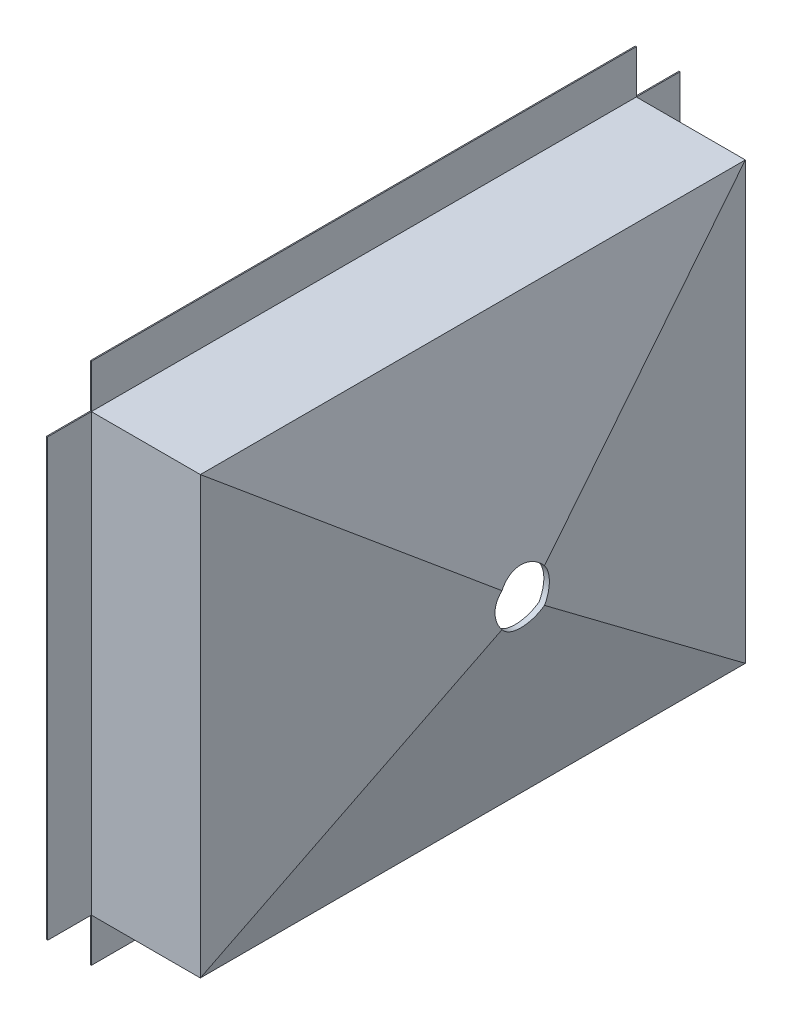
ISO-10303-21;
HEADER;
FILE_DESCRIPTION(('STEP AP214'),'2;1');
FILE_NAME('part.step','',(''),(''),'','','');
FILE_SCHEMA(('AUTOMOTIVE_DESIGN { 1 0 10303 214 1 1 1 1 }'));
ENDSEC;
DATA;
#1=APPLICATION_CONTEXT('core data for automotive mechanical design processes');
#2=APPLICATION_PROTOCOL_DEFINITION('international standard','automotive_design',2000,#1);
#3=PRODUCT_CONTEXT('',#1,'mechanical');
#4=PRODUCT('Part','Part','',(#3));
#5=PRODUCT_RELATED_PRODUCT_CATEGORY('part','',(#4));
#6=PRODUCT_DEFINITION_FORMATION('','',#4);
#7=PRODUCT_DEFINITION_CONTEXT('part definition',#1,'design');
#8=PRODUCT_DEFINITION('design','',#6,#7);
#9=PRODUCT_DEFINITION_SHAPE('','',#8);
#10=(LENGTH_UNIT() NAMED_UNIT(*) SI_UNIT(.MILLI.,.METRE.));
#11=(NAMED_UNIT(*) PLANE_ANGLE_UNIT() SI_UNIT($,.RADIAN.));
#12=(NAMED_UNIT(*) SI_UNIT($,.STERADIAN.) SOLID_ANGLE_UNIT());
#13=UNCERTAINTY_MEASURE_WITH_UNIT(LENGTH_MEASURE(1.E-05),#10,'distance_accuracy_value','');
#14=(GEOMETRIC_REPRESENTATION_CONTEXT(3) GLOBAL_UNCERTAINTY_ASSIGNED_CONTEXT((#13)) GLOBAL_UNIT_ASSIGNED_CONTEXT((#10,
#11,#12)) REPRESENTATION_CONTEXT('',''));
#15=CARTESIAN_POINT('',(0.,0.,0.));
#16=DIRECTION('',(0.,0.,1.));
#17=DIRECTION('',(1.,0.,0.));
#18=AXIS2_PLACEMENT_3D('',#15,#16,#17);
#19=CARTESIAN_POINT('',(0.,-480.,-580.));
#20=DIRECTION('',(1.,0.,0.));
#21=DIRECTION('',(0.,0.,-1.));
#22=AXIS2_PLACEMENT_3D('',#19,#20,#21);
#23=PLANE('',#22);
#24=DIRECTION('',(0.,-1.,0.));
#25=VECTOR('',#24,1.);
#26=CARTESIAN_POINT('',(0.,-400.,-500.));
#27=LINE('',#26,#25);
#28=CARTESIAN_POINT('',(0.,-400.,-500.));
#29=VERTEX_POINT('',#28);
#30=CARTESIAN_POINT('',(0.,-480.,-500.));
#31=VERTEX_POINT('',#30);
#32=EDGE_CURVE('E354',#29,#31,#27,.T.);
#33=ORIENTED_EDGE('',*,*,#32,.F.);
#34=DIRECTION('',(0.,0.,-1.));
#35=VECTOR('',#34,1.);
#36=CARTESIAN_POINT('',(0.,-400.,500.));
#37=LINE('',#36,#35);
#38=CARTESIAN_POINT('',(0.,-400.,499.999999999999));
#39=VERTEX_POINT('',#38);
#40=EDGE_CURVE('E286',#39,#29,#37,.T.);
#41=ORIENTED_EDGE('',*,*,#40,.F.);
#42=DIRECTION('',(0.,1.,0.));
#43=VECTOR('',#42,1.);
#44=CARTESIAN_POINT('',(0.,-400.,499.999999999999));
#45=LINE('',#44,#43);
#46=CARTESIAN_POINT('',(0.,-480.,499.999999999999));
#47=VERTEX_POINT('',#46);
#48=EDGE_CURVE('E353',#47,#39,#45,.T.);
#49=ORIENTED_EDGE('',*,*,#48,.F.);
#50=DIRECTION('',(0.,0.,1.));
#51=VECTOR('',#50,1.);
#52=CARTESIAN_POINT('',(0.,-480.,-580.));
#53=LINE('',#52,#51);
#54=EDGE_CURVE('E265',#31,#47,#53,.T.);
#55=ORIENTED_EDGE('',*,*,#54,.F.);
#56=EDGE_LOOP('',(#33,#41,#49,#55));
#57=FACE_BOUND('',#56,.T.);
#58=ADVANCED_FACE('F27',(#57),#23,.T.);
#59=DIRECTION('',(0.,0.,1.));
#60=VECTOR('',#59,1.);
#61=CARTESIAN_POINT('',(0.,-400.,-500.));
#62=LINE('',#61,#60);
#63=CARTESIAN_POINT('',(0.,-400.,-580.));
#64=VERTEX_POINT('',#63);
#65=EDGE_CURVE('E342',#64,#29,#62,.T.);
#66=ORIENTED_EDGE('',*,*,#65,.F.);
#67=DIRECTION('',(0.,-1.,0.));
#68=VECTOR('',#67,1.);
#69=CARTESIAN_POINT('',(0.,480.,-580.));
#70=LINE('',#69,#68);
#71=CARTESIAN_POINT('',(0.,400.,-580.));
#72=VERTEX_POINT('',#71);
#73=EDGE_CURVE('E271',#72,#64,#70,.T.);
#74=ORIENTED_EDGE('',*,*,#73,.F.);
#75=DIRECTION('',(0.,0.,-1.));
#76=VECTOR('',#75,1.);
#77=CARTESIAN_POINT('',(0.,400.,-500.));
#78=LINE('',#77,#76);
#79=CARTESIAN_POINT('',(0.,400.,-500.));
#80=VERTEX_POINT('',#79);
#81=EDGE_CURVE('E343',#80,#72,#78,.T.);
#82=ORIENTED_EDGE('',*,*,#81,.F.);
#83=DIRECTION('',(0.,1.,0.));
#84=VECTOR('',#83,1.);
#85=CARTESIAN_POINT('',(0.,400.,-500.));
#86=LINE('',#85,#84);
#87=EDGE_CURVE('E289',#29,#80,#86,.T.);
#88=ORIENTED_EDGE('',*,*,#87,.F.);
#89=EDGE_LOOP('',(#66,#74,#82,#88));
#90=FACE_BOUND('',#89,.T.);
#91=ADVANCED_FACE('F339',(#90),#23,.T.);
#92=DIRECTION('',(0.,1.,0.));
#93=VECTOR('',#92,1.);
#94=CARTESIAN_POINT('',(0.,400.,500.));
#95=LINE('',#94,#93);
#96=CARTESIAN_POINT('',(0.,400.,500.));
#97=VERTEX_POINT('',#96);
#98=CARTESIAN_POINT('',(0.,480.,500.));
#99=VERTEX_POINT('',#98);
#100=EDGE_CURVE('E331',#97,#99,#95,.T.);
#101=ORIENTED_EDGE('',*,*,#100,.F.);
#102=DIRECTION('',(0.,0.,1.));
#103=VECTOR('',#102,1.);
#104=CARTESIAN_POINT('',(0.,400.,500.));
#105=LINE('',#104,#103);
#106=EDGE_CURVE('E292',#80,#97,#105,.T.);
#107=ORIENTED_EDGE('',*,*,#106,.F.);
#108=DIRECTION('',(0.,-1.,0.));
#109=VECTOR('',#108,1.);
#110=CARTESIAN_POINT('',(0.,400.,-500.));
#111=LINE('',#110,#109);
#112=CARTESIAN_POINT('',(0.,480.,-500.));
#113=VERTEX_POINT('',#112);
#114=EDGE_CURVE('E330',#113,#80,#111,.T.);
#115=ORIENTED_EDGE('',*,*,#114,.F.);
#116=DIRECTION('',(0.,0.,-1.));
#117=VECTOR('',#116,1.);
#118=CARTESIAN_POINT('',(0.,480.,580.));
#119=LINE('',#118,#117);
#120=EDGE_CURVE('E269',#99,#113,#119,.T.);
#121=ORIENTED_EDGE('',*,*,#120,.F.);
#122=EDGE_LOOP('',(#101,#107,#115,#121));
#123=FACE_BOUND('',#122,.T.);
#124=ADVANCED_FACE('F327',(#123),#23,.T.);
#125=CARTESIAN_POINT('',(-2.,-480.,-580.));
#126=DIRECTION('',(1.,0.,0.));
#127=DIRECTION('',(0.,0.,-1.));
#128=AXIS2_PLACEMENT_3D('',#125,#126,#127);
#129=PLANE('',#128);
#130=DIRECTION('',(0.,0.,1.));
#131=VECTOR('',#130,1.);
#132=CARTESIAN_POINT('',(-2.,-400.,-500.));
#133=LINE('',#132,#131);
#134=CARTESIAN_POINT('',(-2.,-400.,-580.));
#135=VERTEX_POINT('',#134);
#136=CARTESIAN_POINT('',(-2.,-400.,-500.));
#137=VERTEX_POINT('',#136);
#138=EDGE_CURVE('E459',#135,#137,#133,.T.);
#139=ORIENTED_EDGE('',*,*,#138,.T.);
#140=DIRECTION('',(0.,-1.,0.));
#141=VECTOR('',#140,1.);
#142=CARTESIAN_POINT('',(-2.,-400.,-500.));
#143=LINE('',#142,#141);
#144=CARTESIAN_POINT('',(-2.,-480.,-500.));
#145=VERTEX_POINT('',#144);
#146=EDGE_CURVE('E456',#137,#145,#143,.T.);
#147=ORIENTED_EDGE('',*,*,#146,.T.);
#148=DIRECTION('',(0.,0.,1.));
#149=VECTOR('',#148,1.);
#150=CARTESIAN_POINT('',(-2.,-480.,-580.));
#151=LINE('',#150,#149);
#152=CARTESIAN_POINT('',(-2.,-480.,499.999999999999));
#153=VERTEX_POINT('',#152);
#154=EDGE_CURVE('E274',#145,#153,#151,.T.);
#155=ORIENTED_EDGE('',*,*,#154,.T.);
#156=DIRECTION('',(0.,1.,0.));
#157=VECTOR('',#156,1.);
#158=CARTESIAN_POINT('',(-2.,-400.,499.999999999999));
#159=LINE('',#158,#157);
#160=CARTESIAN_POINT('',(-2.,-400.,499.999999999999));
#161=VERTEX_POINT('',#160);
#162=EDGE_CURVE('E365',#153,#161,#159,.T.);
#163=ORIENTED_EDGE('',*,*,#162,.T.);
#164=DIRECTION('',(0.,0.,1.));
#165=VECTOR('',#164,1.);
#166=CARTESIAN_POINT('',(-2.,-400.,499.999999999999));
#167=LINE('',#166,#165);
#168=CARTESIAN_POINT('',(-2.,-400.,580.));
#169=VERTEX_POINT('',#168);
#170=EDGE_CURVE('E368',#161,#169,#167,.T.);
#171=ORIENTED_EDGE('',*,*,#170,.T.);
#172=DIRECTION('',(0.,1.,0.));
#173=VECTOR('',#172,1.);
#174=CARTESIAN_POINT('',(-2.,-480.,580.));
#175=LINE('',#174,#173);
#176=CARTESIAN_POINT('',(-2.,400.,580.));
#177=VERTEX_POINT('',#176);
#178=EDGE_CURVE('E276',#169,#177,#175,.T.);
#179=ORIENTED_EDGE('',*,*,#178,.T.);
#180=DIRECTION('',(0.,0.,-1.));
#181=VECTOR('',#180,1.);
#182=CARTESIAN_POINT('',(-2.,400.,500.));
#183=LINE('',#182,#181);
#184=CARTESIAN_POINT('',(-2.,400.,500.));
#185=VERTEX_POINT('',#184);
#186=EDGE_CURVE('E388',#177,#185,#183,.T.);
#187=ORIENTED_EDGE('',*,*,#186,.T.);
#188=DIRECTION('',(0.,1.,0.));
#189=VECTOR('',#188,1.);
#190=CARTESIAN_POINT('',(-2.,400.,500.));
#191=LINE('',#190,#189);
#192=CARTESIAN_POINT('',(-2.,480.,500.));
#193=VERTEX_POINT('',#192);
#194=EDGE_CURVE('E385',#185,#193,#191,.T.);
#195=ORIENTED_EDGE('',*,*,#194,.T.);
#196=DIRECTION('',(0.,0.,-1.));
#197=VECTOR('',#196,1.);
#198=CARTESIAN_POINT('',(-2.,480.,580.));
#199=LINE('',#198,#197);
#200=CARTESIAN_POINT('',(-2.,480.,-500.));
#201=VERTEX_POINT('',#200);
#202=EDGE_CURVE('E278',#193,#201,#199,.T.);
#203=ORIENTED_EDGE('',*,*,#202,.T.);
#204=DIRECTION('',(0.,-1.,0.));
#205=VECTOR('',#204,1.);
#206=CARTESIAN_POINT('',(-2.,400.,-500.));
#207=LINE('',#206,#205);
#208=CARTESIAN_POINT('',(-2.,400.,-500.));
#209=VERTEX_POINT('',#208);
#210=EDGE_CURVE('E401',#201,#209,#207,.T.);
#211=ORIENTED_EDGE('',*,*,#210,.T.);
#212=DIRECTION('',(0.,0.,-1.));
#213=VECTOR('',#212,1.);
#214=CARTESIAN_POINT('',(-2.,400.,-500.));
#215=LINE('',#214,#213);
#216=CARTESIAN_POINT('',(-2.,400.,-580.));
#217=VERTEX_POINT('',#216);
#218=EDGE_CURVE('E404',#209,#217,#215,.T.);
#219=ORIENTED_EDGE('',*,*,#218,.T.);
#220=DIRECTION('',(0.,-1.,0.));
#221=VECTOR('',#220,1.);
#222=CARTESIAN_POINT('',(-2.,480.,-580.));
#223=LINE('',#222,#221);
#224=EDGE_CURVE('E280',#217,#135,#223,.T.);
#225=ORIENTED_EDGE('',*,*,#224,.T.);
#226=EDGE_LOOP('',(#139,#147,#155,#163,#171,#179,#187,#195,#203,#211,#219,#225));
#227=FACE_BOUND('',#226,.T.);
#228=DIRECTION('',(0.,-1.,0.));
#229=VECTOR('',#228,1.);
#230=CARTESIAN_POINT('',(-2.,-480.,-490.));
#231=LINE('',#230,#229);
#232=CARTESIAN_POINT('',(-2.,390.,-490.));
#233=VERTEX_POINT('',#232);
#234=CARTESIAN_POINT('',(-2.,-390.,-490.));
#235=VERTEX_POINT('',#234);
#236=EDGE_CURVE('E241',#233,#235,#231,.T.);
#237=ORIENTED_EDGE('',*,*,#236,.F.);
#238=DIRECTION('',(0.,0.,-1.));
#239=VECTOR('',#238,1.);
#240=CARTESIAN_POINT('',(-2.,390.,-580.));
#241=LINE('',#240,#239);
#242=CARTESIAN_POINT('',(-2.,390.,490.));
#243=VERTEX_POINT('',#242);
#244=EDGE_CURVE('E239',#243,#233,#241,.T.);
#245=ORIENTED_EDGE('',*,*,#244,.F.);
#246=DIRECTION('',(0.,1.,0.));
#247=VECTOR('',#246,1.);
#248=CARTESIAN_POINT('',(-2.,-480.,490.));
#249=LINE('',#248,#247);
#250=CARTESIAN_POINT('',(-2.,-390.,490.));
#251=VERTEX_POINT('',#250);
#252=EDGE_CURVE('E236',#251,#243,#249,.T.);
#253=ORIENTED_EDGE('',*,*,#252,.F.);
#254=DIRECTION('',(0.,0.,1.));
#255=VECTOR('',#254,1.);
#256=CARTESIAN_POINT('',(-2.,-390.,-580.));
#257=LINE('',#256,#255);
#258=EDGE_CURVE('E243',#235,#251,#257,.T.);
#259=ORIENTED_EDGE('',*,*,#258,.F.);
#260=EDGE_LOOP('',(#237,#245,#253,#259));
#261=FACE_BOUND('',#260,.T.);
#262=ADVANCED_FACE('F434',(#227,#261),#129,.F.);
#263=CARTESIAN_POINT('',(300.,-400.,500.));
#264=DIRECTION('',(0.,1.,0.));
#265=DIRECTION('',(0.,0.,1.));
#266=AXIS2_PLACEMENT_3D('',#263,#264,#265);
#267=PLANE('',#266);
#268=DIRECTION('',(0.,0.,-1.));
#269=VECTOR('',#268,1.);
#270=CARTESIAN_POINT('',(200.,-400.,580.));
#271=LINE('',#270,#269);
#272=CARTESIAN_POINT('',(200.,-400.,499.999999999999));
#273=VERTEX_POINT('',#272);
#274=CARTESIAN_POINT('',(200.,-400.,-500.));
#275=VERTEX_POINT('',#274);
#276=EDGE_CURVE('E245',#273,#275,#271,.T.);
#277=ORIENTED_EDGE('',*,*,#276,.F.);
#278=DIRECTION('',(-1.,0.,0.));
#279=VECTOR('',#278,1.);
#280=CARTESIAN_POINT('',(300.,-400.,500.));
#281=LINE('',#280,#279);
#282=EDGE_CURVE('E304',#273,#39,#281,.T.);
#283=ORIENTED_EDGE('',*,*,#282,.T.);
#284=ORIENTED_EDGE('',*,*,#40,.T.);
#285=DIRECTION('',(-1.,0.,0.));
#286=VECTOR('',#285,1.);
#287=CARTESIAN_POINT('',(300.,-400.,-500.));
#288=LINE('',#287,#286);
#289=EDGE_CURVE('E301',#275,#29,#288,.T.);
#290=ORIENTED_EDGE('',*,*,#289,.F.);
#291=EDGE_LOOP('',(#277,#283,#284,#290));
#292=FACE_BOUND('',#291,.T.);
#293=ADVANCED_FACE('F347',(#292),#267,.F.);
#294=CARTESIAN_POINT('',(300.,480.,0.));
#295=DIRECTION('',(-0.98058067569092,0.,0.196116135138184));
#296=DIRECTION('',(0.196116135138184,0.,0.98058067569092));
#297=AXIS2_PLACEMENT_3D('',#294,#295,#296);
#298=PLANE('',#297);
#299=DIRECTION('',(0.154303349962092,-0.617213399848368,0.771516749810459));
#300=VECTOR('',#299,1.);
#301=CARTESIAN_POINT('',(254.285714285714,182.857142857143,-228.571428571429));
#302=LINE('',#301,#300);
#303=CARTESIAN_POINT('',(200.,400.,-500.));
#304=VERTEX_POINT('',#303);
#305=CARTESIAN_POINT('',(292.124589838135,31.5016406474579,-39.3770508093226));
#306=VERTEX_POINT('',#305);
#307=EDGE_CURVE('E256',#304,#306,#302,.T.);
#308=ORIENTED_EDGE('',*,*,#307,.T.);
#309=CARTESIAN_POINT('',(299.890274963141,0.,-0.548625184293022));
#310=DIRECTION('',(-0.98058067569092,0.,0.196116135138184));
#311=DIRECTION('',(-0.196116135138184,0.,-0.98058067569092));
#312=AXIS2_PLACEMENT_3D('',#309,#310,#311);
#313=ELLIPSE('',#312,50.9901951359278,50.);
#314=CARTESIAN_POINT('',(292.124589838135,-31.5016406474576,-39.3770508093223));
#315=VERTEX_POINT('',#314);
#316=EDGE_CURVE('E450',#306,#315,#313,.T.);
#317=ORIENTED_EDGE('',*,*,#316,.T.);
#318=DIRECTION('',(0.154303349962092,0.617213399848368,0.771516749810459));
#319=VECTOR('',#318,1.);
#320=CARTESIAN_POINT('',(345.714285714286,182.857142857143,228.571428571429));
#321=LINE('',#320,#319);
#322=EDGE_CURVE('E250',#275,#315,#321,.T.);
#323=ORIENTED_EDGE('',*,*,#322,.F.);
#324=DIRECTION('',(0.,-1.,0.));
#325=VECTOR('',#324,1.);
#326=CARTESIAN_POINT('',(200.,480.,-500.));
#327=LINE('',#326,#325);
#328=EDGE_CURVE('E262',#304,#275,#327,.T.);
#329=ORIENTED_EDGE('',*,*,#328,.F.);
#330=EDGE_LOOP('',(#308,#317,#323,#329));
#331=FACE_BOUND('',#330,.T.);
#332=ADVANCED_FACE('F535',(#331),#298,.F.);
#333=CARTESIAN_POINT('',(300.,480.,0.));
#334=DIRECTION('',(0.98058067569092,0.,0.196116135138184));
#335=DIRECTION('',(0.196116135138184,0.,-0.98058067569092));
#336=AXIS2_PLACEMENT_3D('',#333,#334,#335);
#337=PLANE('',#336);
#338=CARTESIAN_POINT('',(300.109725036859,0.,-0.548625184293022));
#339=DIRECTION('',(0.98058067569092,0.,0.196116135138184));
#340=DIRECTION('',(-0.196116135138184,0.,0.98058067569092));
#341=AXIS2_PLACEMENT_3D('',#338,#339,#340);
#342=ELLIPSE('',#341,50.9901951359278,50.);
#343=CARTESIAN_POINT('',(292.258400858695,30.9663965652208,38.7079957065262));
#344=VERTEX_POINT('',#343);
#345=CARTESIAN_POINT('',(292.258400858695,-30.9663965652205,38.7079957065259));
#346=VERTEX_POINT('',#345);
#347=EDGE_CURVE('E42',#344,#346,#342,.T.);
#348=ORIENTED_EDGE('',*,*,#347,.F.);
#349=DIRECTION('',(0.154303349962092,-0.617213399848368,-0.771516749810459));
#350=VECTOR('',#349,1.);
#351=CARTESIAN_POINT('',(254.285714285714,182.857142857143,228.571428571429));
#352=LINE('',#351,#350);
#353=CARTESIAN_POINT('',(200.,400.,500.));
#354=VERTEX_POINT('',#353);
#355=EDGE_CURVE('E35',#354,#344,#352,.T.);
#356=ORIENTED_EDGE('',*,*,#355,.F.);
#357=DIRECTION('',(0.,-1.,0.));
#358=VECTOR('',#357,1.);
#359=CARTESIAN_POINT('',(200.,480.,500.));
#360=LINE('',#359,#358);
#361=EDGE_CURVE('E259',#354,#273,#360,.T.);
#362=ORIENTED_EDGE('',*,*,#361,.T.);
#363=DIRECTION('',(0.154303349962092,0.617213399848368,-0.771516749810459));
#364=VECTOR('',#363,1.);
#365=CARTESIAN_POINT('',(345.714285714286,182.857142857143,-228.571428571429));
#366=LINE('',#365,#364);
#367=EDGE_CURVE('E247',#273,#346,#366,.T.);
#368=ORIENTED_EDGE('',*,*,#367,.T.);
#369=EDGE_LOOP('',(#348,#356,#362,#368));
#370=FACE_BOUND('',#369,.T.);
#371=ADVANCED_FACE('F314',(#370),#337,.T.);
#372=CARTESIAN_POINT('',(300.,400.,500.));
#373=DIRECTION('',(0.,0.,-1.));
#374=DIRECTION('',(-1.,0.,0.));
#375=AXIS2_PLACEMENT_3D('',#372,#373,#374);
#376=PLANE('',#375);
#377=ORIENTED_EDGE('',*,*,#361,.F.);
#378=DIRECTION('',(-1.,0.,0.));
#379=VECTOR('',#378,1.);
#380=CARTESIAN_POINT('',(300.,400.,500.));
#381=LINE('',#380,#379);
#382=EDGE_CURVE('E295',#354,#97,#381,.T.);
#383=ORIENTED_EDGE('',*,*,#382,.T.);
#384=DIRECTION('',(0.,-1.,0.));
#385=VECTOR('',#384,1.);
#386=CARTESIAN_POINT('',(0.,400.,500.));
#387=LINE('',#386,#385);
#388=EDGE_CURVE('E283',#97,#39,#387,.T.);
#389=ORIENTED_EDGE('',*,*,#388,.T.);
#390=ORIENTED_EDGE('',*,*,#282,.F.);
#391=EDGE_LOOP('',(#377,#383,#389,#390));
#392=FACE_BOUND('',#391,.T.);
#393=ADVANCED_FACE('F29',(#392),#376,.F.);
#394=CARTESIAN_POINT('',(300.,400.,500.));
#395=DIRECTION('',(0.,-1.,0.));
#396=DIRECTION('',(0.,0.,-1.));
#397=AXIS2_PLACEMENT_3D('',#394,#395,#396);
#398=PLANE('',#397);
#399=ORIENTED_EDGE('',*,*,#382,.F.);
#400=DIRECTION('',(0.,0.,-1.));
#401=VECTOR('',#400,1.);
#402=CARTESIAN_POINT('',(200.,400.,580.));
#403=LINE('',#402,#401);
#404=EDGE_CURVE('E253',#354,#304,#403,.T.);
#405=ORIENTED_EDGE('',*,*,#404,.T.);
#406=DIRECTION('',(-1.,0.,0.));
#407=VECTOR('',#406,1.);
#408=CARTESIAN_POINT('',(300.,400.,-500.));
#409=LINE('',#408,#407);
#410=EDGE_CURVE('E298',#304,#80,#409,.T.);
#411=ORIENTED_EDGE('',*,*,#410,.T.);
#412=ORIENTED_EDGE('',*,*,#106,.T.);
#413=EDGE_LOOP('',(#399,#405,#411,#412));
#414=FACE_BOUND('',#413,.T.);
#415=ADVANCED_FACE('F320',(#414),#398,.F.);
#416=CARTESIAN_POINT('',(300.,400.,-500.));
#417=DIRECTION('',(0.,0.,1.));
#418=DIRECTION('',(1.,0.,0.));
#419=AXIS2_PLACEMENT_3D('',#416,#417,#418);
#420=PLANE('',#419);
#421=ORIENTED_EDGE('',*,*,#410,.F.);
#422=ORIENTED_EDGE('',*,*,#328,.T.);
#423=ORIENTED_EDGE('',*,*,#289,.T.);
#424=ORIENTED_EDGE('',*,*,#87,.T.);
#425=EDGE_LOOP('',(#421,#422,#423,#424));
#426=FACE_BOUND('',#425,.T.);
#427=ADVANCED_FACE('F334',(#426),#420,.F.);
#428=DIRECTION('',(0.,0.,1.));
#429=VECTOR('',#428,1.);
#430=CARTESIAN_POINT('',(0.,-400.,499.999999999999));
#431=LINE('',#430,#429);
#432=CARTESIAN_POINT('',(0.,-400.,580.));
#433=VERTEX_POINT('',#432);
#434=EDGE_CURVE('E362',#39,#433,#431,.T.);
#435=ORIENTED_EDGE('',*,*,#434,.F.);
#436=ORIENTED_EDGE('',*,*,#388,.F.);
#437=DIRECTION('',(0.,0.,-1.));
#438=VECTOR('',#437,1.);
#439=CARTESIAN_POINT('',(0.,400.,500.));
#440=LINE('',#439,#438);
#441=CARTESIAN_POINT('',(0.,400.,580.));
#442=VERTEX_POINT('',#441);
#443=EDGE_CURVE('E361',#442,#97,#440,.T.);
#444=ORIENTED_EDGE('',*,*,#443,.F.);
#445=DIRECTION('',(0.,1.,0.));
#446=VECTOR('',#445,1.);
#447=CARTESIAN_POINT('',(0.,-480.,580.));
#448=LINE('',#447,#446);
#449=EDGE_CURVE('E267',#433,#442,#448,.T.);
#450=ORIENTED_EDGE('',*,*,#449,.F.);
#451=EDGE_LOOP('',(#435,#436,#444,#450));
#452=FACE_BOUND('',#451,.T.);
#453=ADVANCED_FACE('F358',(#452),#23,.T.);
#454=CARTESIAN_POINT('',(-2.,-480.,-580.));
#455=DIRECTION('',(0.,1.,0.));
#456=DIRECTION('',(0.,0.,1.));
#457=AXIS2_PLACEMENT_3D('',#454,#455,#456);
#458=PLANE('',#457);
#459=ORIENTED_EDGE('',*,*,#154,.F.);
#460=DIRECTION('',(1.,0.,0.));
#461=VECTOR('',#460,1.);
#462=CARTESIAN_POINT('',(-2.,-480.,-500.));
#463=LINE('',#462,#461);
#464=EDGE_CURVE('E462',#145,#31,#463,.T.);
#465=ORIENTED_EDGE('',*,*,#464,.T.);
#466=ORIENTED_EDGE('',*,*,#54,.T.);
#467=DIRECTION('',(1.,0.,0.));
#468=VECTOR('',#467,1.);
#469=CARTESIAN_POINT('',(-2.,-480.,499.999999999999));
#470=LINE('',#469,#468);
#471=EDGE_CURVE('E377',#153,#47,#470,.T.);
#472=ORIENTED_EDGE('',*,*,#471,.F.);
#473=EDGE_LOOP('',(#459,#465,#466,#472));
#474=FACE_BOUND('',#473,.T.);
#475=ADVANCED_FACE('F468',(#474),#458,.F.);
#476=CARTESIAN_POINT('',(-2.,-480.,580.));
#477=DIRECTION('',(0.,0.,-1.));
#478=DIRECTION('',(-1.,0.,0.));
#479=AXIS2_PLACEMENT_3D('',#476,#477,#478);
#480=PLANE('',#479);
#481=ORIENTED_EDGE('',*,*,#178,.F.);
#482=DIRECTION('',(1.,0.,0.));
#483=VECTOR('',#482,1.);
#484=CARTESIAN_POINT('',(-2.,-400.,580.));
#485=LINE('',#484,#483);
#486=EDGE_CURVE('E380',#169,#433,#485,.T.);
#487=ORIENTED_EDGE('',*,*,#486,.T.);
#488=ORIENTED_EDGE('',*,*,#449,.T.);
#489=DIRECTION('',(1.,0.,0.));
#490=VECTOR('',#489,1.);
#491=CARTESIAN_POINT('',(-2.,400.,580.));
#492=LINE('',#491,#490);
#493=EDGE_CURVE('E394',#177,#442,#492,.T.);
#494=ORIENTED_EDGE('',*,*,#493,.F.);
#495=EDGE_LOOP('',(#481,#487,#488,#494));
#496=FACE_BOUND('',#495,.T.);
#497=ADVANCED_FACE('F500',(#496),#480,.F.);
#498=CARTESIAN_POINT('',(-2.,480.,580.));
#499=DIRECTION('',(0.,-1.,0.));
#500=DIRECTION('',(0.,0.,-1.));
#501=AXIS2_PLACEMENT_3D('',#498,#499,#500);
#502=PLANE('',#501);
#503=ORIENTED_EDGE('',*,*,#202,.F.);
#504=DIRECTION('',(1.,0.,0.));
#505=VECTOR('',#504,1.);
#506=CARTESIAN_POINT('',(-2.,480.,500.));
#507=LINE('',#506,#505);
#508=EDGE_CURVE('E391',#193,#99,#507,.T.);
#509=ORIENTED_EDGE('',*,*,#508,.T.);
#510=ORIENTED_EDGE('',*,*,#120,.T.);
#511=DIRECTION('',(1.,0.,0.));
#512=VECTOR('',#511,1.);
#513=CARTESIAN_POINT('',(-2.,480.,-500.));
#514=LINE('',#513,#512);
#515=EDGE_CURVE('E208',#201,#113,#514,.T.);
#516=ORIENTED_EDGE('',*,*,#515,.F.);
#517=EDGE_LOOP('',(#503,#509,#510,#516));
#518=FACE_BOUND('',#517,.T.);
#519=ADVANCED_FACE('F490',(#518),#502,.F.);
#520=CARTESIAN_POINT('',(-2.,480.,-580.));
#521=DIRECTION('',(0.,0.,1.));
#522=DIRECTION('',(1.,0.,0.));
#523=AXIS2_PLACEMENT_3D('',#520,#521,#522);
#524=PLANE('',#523);
#525=ORIENTED_EDGE('',*,*,#73,.T.);
#526=DIRECTION('',(1.,0.,0.));
#527=VECTOR('',#526,1.);
#528=CARTESIAN_POINT('',(-2.,-400.,-580.));
#529=LINE('',#528,#527);
#530=EDGE_CURVE('E464',#135,#64,#529,.T.);
#531=ORIENTED_EDGE('',*,*,#530,.F.);
#532=ORIENTED_EDGE('',*,*,#224,.F.);
#533=DIRECTION('',(1.,0.,0.));
#534=VECTOR('',#533,1.);
#535=CARTESIAN_POINT('',(-2.,400.,-580.));
#536=LINE('',#535,#534);
#537=EDGE_CURVE('E410',#217,#72,#536,.T.);
#538=ORIENTED_EDGE('',*,*,#537,.T.);
#539=EDGE_LOOP('',(#525,#531,#532,#538));
#540=FACE_BOUND('',#539,.T.);
#541=ADVANCED_FACE('F480',(#540),#524,.F.);
#542=CARTESIAN_POINT('',(200.,400.,580.));
#543=DIRECTION('',(-0.970142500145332,-0.242535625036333,0.));
#544=DIRECTION('',(0.242535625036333,-0.970142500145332,0.));
#545=AXIS2_PLACEMENT_3D('',#542,#543,#544);
#546=PLANE('',#545);
#547=ORIENTED_EDGE('',*,*,#355,.T.);
#548=CARTESIAN_POINT('',(300.,0.,-0.548625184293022));
#549=DIRECTION('',(-0.970142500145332,-0.242535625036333,0.));
#550=DIRECTION('',(-0.242535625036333,0.970142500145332,0.));
#551=AXIS2_PLACEMENT_3D('',#548,#549,#550);
#552=ELLIPSE('',#551,51.5388203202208,50.);
#553=EDGE_CURVE('E311',#344,#306,#552,.T.);
#554=ORIENTED_EDGE('',*,*,#553,.T.);
#555=ORIENTED_EDGE('',*,*,#307,.F.);
#556=ORIENTED_EDGE('',*,*,#404,.F.);
#557=EDGE_LOOP('',(#547,#554,#555,#556));
#558=FACE_BOUND('',#557,.T.);
#559=ADVANCED_FACE('F310',(#558),#546,.F.);
#560=CARTESIAN_POINT('',(200.,-400.,580.));
#561=DIRECTION('',(0.970142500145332,-0.242535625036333,0.));
#562=DIRECTION('',(0.242535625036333,0.970142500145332,0.));
#563=AXIS2_PLACEMENT_3D('',#560,#561,#562);
#564=PLANE('',#563);
#565=CARTESIAN_POINT('',(300.,0.,-0.548625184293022));
#566=DIRECTION('',(0.970142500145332,-0.242535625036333,0.));
#567=DIRECTION('',(-0.242535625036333,-0.970142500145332,0.));
#568=AXIS2_PLACEMENT_3D('',#565,#566,#567);
#569=ELLIPSE('',#568,51.5388203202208,50.);
#570=EDGE_CURVE('E445',#346,#315,#569,.T.);
#571=ORIENTED_EDGE('',*,*,#570,.F.);
#572=ORIENTED_EDGE('',*,*,#367,.F.);
#573=ORIENTED_EDGE('',*,*,#276,.T.);
#574=ORIENTED_EDGE('',*,*,#322,.T.);
#575=EDGE_LOOP('',(#571,#572,#573,#574));
#576=FACE_BOUND('',#575,.T.);
#577=ADVANCED_FACE('F558',(#576),#564,.T.);
#578=CARTESIAN_POINT('',(300.,-390.,500.));
#579=DIRECTION('',(0.,1.,0.));
#580=DIRECTION('',(0.,0.,1.));
#581=AXIS2_PLACEMENT_3D('',#578,#579,#580);
#582=PLANE('',#581);
#583=ORIENTED_EDGE('',*,*,#258,.T.);
#584=DIRECTION('',(-1.,0.,0.));
#585=VECTOR('',#584,1.);
#586=CARTESIAN_POINT('',(300.,-390.,490.));
#587=LINE('',#586,#585);
#588=CARTESIAN_POINT('',(191.801960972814,-390.,490.));
#589=VERTEX_POINT('',#588);
#590=EDGE_CURVE('E216',#589,#251,#587,.T.);
#591=ORIENTED_EDGE('',*,*,#590,.F.);
#592=DIRECTION('',(0.196116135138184,0.,-0.98058067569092));
#593=VECTOR('',#592,1.);
#594=CARTESIAN_POINT('',(194.040347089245,-390.,478.808069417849));
#595=LINE('',#594,#593);
#596=CARTESIAN_POINT('',(192.192235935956,-390.,488.048625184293));
#597=VERTEX_POINT('',#596);
#598=EDGE_CURVE('E229',#589,#597,#595,.T.);
#599=ORIENTED_EDGE('',*,*,#598,.T.);
#600=DIRECTION('',(0.,0.,-1.));
#601=VECTOR('',#600,1.);
#602=CARTESIAN_POINT('',(192.192235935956,-390.,500.));
#603=LINE('',#602,#601);
#604=CARTESIAN_POINT('',(192.192235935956,-390.,-488.048625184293));
#605=VERTEX_POINT('',#604);
#606=EDGE_CURVE('E203',#597,#605,#603,.T.);
#607=ORIENTED_EDGE('',*,*,#606,.T.);
#608=DIRECTION('',(-0.196116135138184,0.,-0.98058067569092));
#609=VECTOR('',#608,1.);
#610=CARTESIAN_POINT('',(290.194193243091,-390.,1.96116135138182));
#611=LINE('',#610,#609);
#612=CARTESIAN_POINT('',(191.801960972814,-390.,-490.));
#613=VERTEX_POINT('',#612);
#614=EDGE_CURVE('E215',#605,#613,#611,.T.);
#615=ORIENTED_EDGE('',*,*,#614,.T.);
#616=DIRECTION('',(-1.,0.,0.));
#617=VECTOR('',#616,1.);
#618=CARTESIAN_POINT('',(300.,-390.,-490.));
#619=LINE('',#618,#617);
#620=EDGE_CURVE('E226',#613,#235,#619,.T.);
#621=ORIENTED_EDGE('',*,*,#620,.T.);
#622=EDGE_LOOP('',(#583,#591,#599,#607,#615,#621));
#623=FACE_BOUND('',#622,.T.);
#624=ADVANCED_FACE('F430',(#623),#582,.T.);
#625=CARTESIAN_POINT('',(290.194193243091,480.,1.96116135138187));
#626=DIRECTION('',(-0.98058067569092,0.,0.196116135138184));
#627=DIRECTION('',(0.196116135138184,0.,0.98058067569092));
#628=AXIS2_PLACEMENT_3D('',#625,#626,#627);
#629=PLANE('',#628);
#630=CARTESIAN_POINT('',(289.692235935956,0.,-0.548625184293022));
#631=DIRECTION('',(-0.98058067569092,0.,0.196116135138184));
#632=DIRECTION('',(-0.196116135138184,0.,-0.98058067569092));
#633=AXIS2_PLACEMENT_3D('',#630,#631,#632);
#634=ELLIPSE('',#633,50.9901951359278,50.);
#635=CARTESIAN_POINT('',(281.883547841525,31.2347523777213,-39.5920656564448));
#636=VERTEX_POINT('',#635);
#637=CARTESIAN_POINT('',(281.883547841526,-31.2347523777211,-39.5920656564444));
#638=VERTEX_POINT('',#637);
#639=EDGE_CURVE('E50',#636,#638,#634,.T.);
#640=ORIENTED_EDGE('',*,*,#639,.F.);
#641=DIRECTION('',(0.154303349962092,-0.617213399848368,0.771516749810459));
#642=VECTOR('',#641,1.);
#643=CARTESIAN_POINT('',(244.288685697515,181.614200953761,-227.566376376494));
#644=LINE('',#643,#642);
#645=CARTESIAN_POINT('',(192.192235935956,390.,-488.048625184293));
#646=VERTEX_POINT('',#645);
#647=EDGE_CURVE('E223',#646,#636,#644,.T.);
#648=ORIENTED_EDGE('',*,*,#647,.F.);
#649=DIRECTION('',(-0.196116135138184,0.,-0.98058067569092));
#650=VECTOR('',#649,1.);
#651=CARTESIAN_POINT('',(386.348039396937,390.,482.730392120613));
#652=LINE('',#651,#650);
#653=CARTESIAN_POINT('',(191.801960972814,390.,-490.));
#654=VERTEX_POINT('',#653);
#655=EDGE_CURVE('E233',#646,#654,#652,.T.);
#656=ORIENTED_EDGE('',*,*,#655,.T.);
#657=DIRECTION('',(0.,-1.,0.));
#658=VECTOR('',#657,1.);
#659=CARTESIAN_POINT('',(191.801960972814,400.,-490.));
#660=LINE('',#659,#658);
#661=EDGE_CURVE('E220',#654,#613,#660,.T.);
#662=ORIENTED_EDGE('',*,*,#661,.T.);
#663=ORIENTED_EDGE('',*,*,#614,.F.);
#664=DIRECTION('',(0.154303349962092,0.617213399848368,0.771516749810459));
#665=VECTOR('',#664,1.);
#666=CARTESIAN_POINT('',(335.717257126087,184.100084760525,229.576480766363));
#667=LINE('',#666,#665);
#668=EDGE_CURVE('E204',#605,#638,#667,.T.);
#669=ORIENTED_EDGE('',*,*,#668,.T.);
#670=EDGE_LOOP('',(#640,#648,#656,#662,#663,#669));
#671=FACE_BOUND('',#670,.T.);
#672=ADVANCED_FACE('F442',(#671),#629,.T.);
#673=CARTESIAN_POINT('',(290.194193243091,480.,-1.96116135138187));
#674=DIRECTION('',(0.98058067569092,0.,0.196116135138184));
#675=DIRECTION('',(0.196116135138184,0.,-0.98058067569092));
#676=AXIS2_PLACEMENT_3D('',#673,#674,#675);
#677=PLANE('',#676);
#678=DIRECTION('',(0.154303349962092,-0.617213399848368,-0.771516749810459));
#679=VECTOR('',#678,1.);
#680=CARTESIAN_POINT('',(244.288685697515,181.614200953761,227.566376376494));
#681=LINE('',#680,#679);
#682=CARTESIAN_POINT('',(192.192235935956,390.,488.048625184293));
#683=VERTEX_POINT('',#682);
#684=CARTESIAN_POINT('',(282.018092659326,30.6965731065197,38.9193415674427));
#685=VERTEX_POINT('',#684);
#686=EDGE_CURVE('E199',#683,#685,#681,.T.);
#687=ORIENTED_EDGE('',*,*,#686,.T.);
#688=CARTESIAN_POINT('',(289.911686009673,0.,-0.548625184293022));
#689=DIRECTION('',(0.98058067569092,0.,0.196116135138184));
#690=DIRECTION('',(-0.196116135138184,0.,0.98058067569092));
#691=AXIS2_PLACEMENT_3D('',#688,#689,#690);
#692=ELLIPSE('',#691,50.9901951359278,50.);
#693=CARTESIAN_POINT('',(282.018092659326,-30.6965731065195,38.9193415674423));
#694=VERTEX_POINT('',#693);
#695=EDGE_CURVE('E186',#685,#694,#692,.T.);
#696=ORIENTED_EDGE('',*,*,#695,.T.);
#697=DIRECTION('',(0.154303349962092,0.617213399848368,-0.771516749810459));
#698=VECTOR('',#697,1.);
#699=CARTESIAN_POINT('',(335.717257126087,184.100084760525,-229.576480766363));
#700=LINE('',#699,#698);
#701=EDGE_CURVE('E196',#597,#694,#700,.T.);
#702=ORIENTED_EDGE('',*,*,#701,.F.);
#703=ORIENTED_EDGE('',*,*,#598,.F.);
#704=DIRECTION('',(0.,-1.,0.));
#705=VECTOR('',#704,1.);
#706=CARTESIAN_POINT('',(191.801960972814,400.,490.));
#707=LINE('',#706,#705);
#708=CARTESIAN_POINT('',(191.801960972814,390.,490.));
#709=VERTEX_POINT('',#708);
#710=EDGE_CURVE('E212',#709,#589,#707,.T.);
#711=ORIENTED_EDGE('',*,*,#710,.F.);
#712=DIRECTION('',(0.196116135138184,0.,-0.98058067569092));
#713=VECTOR('',#712,1.);
#714=CARTESIAN_POINT('',(290.194193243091,390.,-1.96116135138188));
#715=LINE('',#714,#713);
#716=EDGE_CURVE('E231',#709,#683,#715,.T.);
#717=ORIENTED_EDGE('',*,*,#716,.T.);
#718=EDGE_LOOP('',(#687,#696,#702,#703,#711,#717));
#719=FACE_BOUND('',#718,.T.);
#720=ADVANCED_FACE('F195',(#719),#677,.F.);
#721=CARTESIAN_POINT('',(300.,400.,490.));
#722=DIRECTION('',(0.,0.,-1.));
#723=DIRECTION('',(-1.,0.,0.));
#724=AXIS2_PLACEMENT_3D('',#721,#722,#723);
#725=PLANE('',#724);
#726=ORIENTED_EDGE('',*,*,#252,.T.);
#727=DIRECTION('',(-1.,0.,0.));
#728=VECTOR('',#727,1.);
#729=CARTESIAN_POINT('',(300.,390.,490.));
#730=LINE('',#729,#728);
#731=EDGE_CURVE('E217',#709,#243,#730,.T.);
#732=ORIENTED_EDGE('',*,*,#731,.F.);
#733=ORIENTED_EDGE('',*,*,#710,.T.);
#734=ORIENTED_EDGE('',*,*,#590,.T.);
#735=EDGE_LOOP('',(#726,#732,#733,#734));
#736=FACE_BOUND('',#735,.T.);
#737=ADVANCED_FACE('F427',(#736),#725,.T.);
#738=CARTESIAN_POINT('',(300.,390.,500.));
#739=DIRECTION('',(0.,-1.,0.));
#740=DIRECTION('',(0.,0.,-1.));
#741=AXIS2_PLACEMENT_3D('',#738,#739,#740);
#742=PLANE('',#741);
#743=ORIENTED_EDGE('',*,*,#244,.T.);
#744=DIRECTION('',(-1.,0.,0.));
#745=VECTOR('',#744,1.);
#746=CARTESIAN_POINT('',(300.,390.,-490.));
#747=LINE('',#746,#745);
#748=EDGE_CURVE('E219',#654,#233,#747,.T.);
#749=ORIENTED_EDGE('',*,*,#748,.F.);
#750=ORIENTED_EDGE('',*,*,#655,.F.);
#751=DIRECTION('',(0.,0.,-1.));
#752=VECTOR('',#751,1.);
#753=CARTESIAN_POINT('',(192.192235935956,390.,500.));
#754=LINE('',#753,#752);
#755=EDGE_CURVE('E206',#683,#646,#754,.T.);
#756=ORIENTED_EDGE('',*,*,#755,.F.);
#757=ORIENTED_EDGE('',*,*,#716,.F.);
#758=ORIENTED_EDGE('',*,*,#731,.T.);
#759=EDGE_LOOP('',(#743,#749,#750,#756,#757,#758));
#760=FACE_BOUND('',#759,.T.);
#761=ADVANCED_FACE('F438',(#760),#742,.T.);
#762=CARTESIAN_POINT('',(300.,400.,-490.));
#763=DIRECTION('',(0.,0.,1.));
#764=DIRECTION('',(1.,0.,0.));
#765=AXIS2_PLACEMENT_3D('',#762,#763,#764);
#766=PLANE('',#765);
#767=ORIENTED_EDGE('',*,*,#236,.T.);
#768=ORIENTED_EDGE('',*,*,#620,.F.);
#769=ORIENTED_EDGE('',*,*,#661,.F.);
#770=ORIENTED_EDGE('',*,*,#748,.T.);
#771=EDGE_LOOP('',(#767,#768,#769,#770));
#772=FACE_BOUND('',#771,.T.);
#773=ADVANCED_FACE('F440',(#772),#766,.T.);
#774=CARTESIAN_POINT('',(190.298574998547,397.574643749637,580.));
#775=DIRECTION('',(-0.970142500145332,-0.242535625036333,0.));
#776=DIRECTION('',(0.242535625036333,-0.970142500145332,0.));
#777=AXIS2_PLACEMENT_3D('',#774,#775,#776);
#778=PLANE('',#777);
#779=CARTESIAN_POINT('',(289.692235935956,0.,-0.548625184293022));
#780=DIRECTION('',(-0.970142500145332,-0.242535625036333,0.));
#781=DIRECTION('',(-0.242535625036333,0.970142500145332,0.));
#782=AXIS2_PLACEMENT_3D('',#779,#780,#781);
#783=ELLIPSE('',#782,51.5388203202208,50.);
#784=EDGE_CURVE('E443',#685,#636,#783,.T.);
#785=ORIENTED_EDGE('',*,*,#784,.F.);
#786=ORIENTED_EDGE('',*,*,#686,.F.);
#787=ORIENTED_EDGE('',*,*,#755,.T.);
#788=ORIENTED_EDGE('',*,*,#647,.T.);
#789=EDGE_LOOP('',(#785,#786,#787,#788));
#790=FACE_BOUND('',#789,.T.);
#791=ADVANCED_FACE('F564',(#790),#778,.T.);
#792=CARTESIAN_POINT('',(190.298574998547,-397.574643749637,580.));
#793=DIRECTION('',(0.970142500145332,-0.242535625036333,0.));
#794=DIRECTION('',(0.242535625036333,0.970142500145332,0.));
#795=AXIS2_PLACEMENT_3D('',#792,#793,#794);
#796=PLANE('',#795);
#797=ORIENTED_EDGE('',*,*,#701,.T.);
#798=CARTESIAN_POINT('',(289.692235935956,0.,-0.548625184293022));
#799=DIRECTION('',(0.970142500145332,-0.242535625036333,0.));
#800=DIRECTION('',(-0.242535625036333,-0.970142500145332,0.));
#801=AXIS2_PLACEMENT_3D('',#798,#799,#800);
#802=ELLIPSE('',#801,51.5388203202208,50.);
#803=EDGE_CURVE('E11',#694,#638,#802,.T.);
#804=ORIENTED_EDGE('',*,*,#803,.T.);
#805=ORIENTED_EDGE('',*,*,#668,.F.);
#806=ORIENTED_EDGE('',*,*,#606,.F.);
#807=EDGE_LOOP('',(#797,#804,#805,#806));
#808=FACE_BOUND('',#807,.T.);
#809=ADVANCED_FACE('F201',(#808),#796,.F.);
#810=CARTESIAN_POINT('',(-2.,400.,-500.));
#811=DIRECTION('',(0.,0.,1.));
#812=DIRECTION('',(1.,0.,0.));
#813=AXIS2_PLACEMENT_3D('',#810,#811,#812);
#814=PLANE('',#813);
#815=ORIENTED_EDGE('',*,*,#114,.T.);
#816=DIRECTION('',(1.,0.,0.));
#817=VECTOR('',#816,1.);
#818=CARTESIAN_POINT('',(-2.,400.,-500.));
#819=LINE('',#818,#817);
#820=EDGE_CURVE('E407',#209,#80,#819,.T.);
#821=ORIENTED_EDGE('',*,*,#820,.F.);
#822=ORIENTED_EDGE('',*,*,#210,.F.);
#823=ORIENTED_EDGE('',*,*,#515,.T.);
#824=EDGE_LOOP('',(#815,#821,#822,#823));
#825=FACE_BOUND('',#824,.T.);
#826=ADVANCED_FACE('F488',(#825),#814,.F.);
#827=CARTESIAN_POINT('',(-2.,400.,-500.));
#828=DIRECTION('',(0.,-1.,0.));
#829=DIRECTION('',(0.,0.,-1.));
#830=AXIS2_PLACEMENT_3D('',#827,#828,#829);
#831=PLANE('',#830);
#832=ORIENTED_EDGE('',*,*,#81,.T.);
#833=ORIENTED_EDGE('',*,*,#537,.F.);
#834=ORIENTED_EDGE('',*,*,#218,.F.);
#835=ORIENTED_EDGE('',*,*,#820,.T.);
#836=EDGE_LOOP('',(#832,#833,#834,#835));
#837=FACE_BOUND('',#836,.T.);
#838=ADVANCED_FACE('F483',(#837),#831,.F.);
#839=CARTESIAN_POINT('',(-2.,400.,500.));
#840=DIRECTION('',(0.,0.,-1.));
#841=DIRECTION('',(-1.,0.,0.));
#842=AXIS2_PLACEMENT_3D('',#839,#840,#841);
#843=PLANE('',#842);
#844=ORIENTED_EDGE('',*,*,#100,.T.);
#845=ORIENTED_EDGE('',*,*,#508,.F.);
#846=ORIENTED_EDGE('',*,*,#194,.F.);
#847=DIRECTION('',(1.,0.,0.));
#848=VECTOR('',#847,1.);
#849=CARTESIAN_POINT('',(-2.,400.,500.));
#850=LINE('',#849,#848);
#851=EDGE_CURVE('E392',#185,#97,#850,.T.);
#852=ORIENTED_EDGE('',*,*,#851,.T.);
#853=EDGE_LOOP('',(#844,#845,#846,#852));
#854=FACE_BOUND('',#853,.T.);
#855=ADVANCED_FACE('F493',(#854),#843,.F.);
#856=CARTESIAN_POINT('',(-2.,400.,500.));
#857=DIRECTION('',(0.,-1.,0.));
#858=DIRECTION('',(0.,0.,-1.));
#859=AXIS2_PLACEMENT_3D('',#856,#857,#858);
#860=PLANE('',#859);
#861=ORIENTED_EDGE('',*,*,#443,.T.);
#862=ORIENTED_EDGE('',*,*,#851,.F.);
#863=ORIENTED_EDGE('',*,*,#186,.F.);
#864=ORIENTED_EDGE('',*,*,#493,.T.);
#865=EDGE_LOOP('',(#861,#862,#863,#864));
#866=FACE_BOUND('',#865,.T.);
#867=ADVANCED_FACE('F498',(#866),#860,.F.);
#868=CARTESIAN_POINT('',(-2.,-400.,499.999999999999));
#869=DIRECTION('',(0.,0.,-1.));
#870=DIRECTION('',(-1.,0.,0.));
#871=AXIS2_PLACEMENT_3D('',#868,#869,#870);
#872=PLANE('',#871);
#873=ORIENTED_EDGE('',*,*,#48,.T.);
#874=DIRECTION('',(1.,0.,0.));
#875=VECTOR('',#874,1.);
#876=CARTESIAN_POINT('',(-2.,-400.,499.999999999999));
#877=LINE('',#876,#875);
#878=EDGE_CURVE('E376',#161,#39,#877,.T.);
#879=ORIENTED_EDGE('',*,*,#878,.F.);
#880=ORIENTED_EDGE('',*,*,#162,.F.);
#881=ORIENTED_EDGE('',*,*,#471,.T.);
#882=EDGE_LOOP('',(#873,#879,#880,#881));
#883=FACE_BOUND('',#882,.T.);
#884=ADVANCED_FACE('F504',(#883),#872,.F.);
#885=CARTESIAN_POINT('',(-2.,-400.,499.999999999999));
#886=DIRECTION('',(0.,1.,0.));
#887=DIRECTION('',(0.,0.,1.));
#888=AXIS2_PLACEMENT_3D('',#885,#886,#887);
#889=PLANE('',#888);
#890=ORIENTED_EDGE('',*,*,#434,.T.);
#891=ORIENTED_EDGE('',*,*,#486,.F.);
#892=ORIENTED_EDGE('',*,*,#170,.F.);
#893=ORIENTED_EDGE('',*,*,#878,.T.);
#894=EDGE_LOOP('',(#890,#891,#892,#893));
#895=FACE_BOUND('',#894,.T.);
#896=ADVANCED_FACE('F502',(#895),#889,.F.);
#897=CARTESIAN_POINT('',(-2.,-400.,-500.));
#898=DIRECTION('',(0.,0.,1.));
#899=DIRECTION('',(1.,0.,0.));
#900=AXIS2_PLACEMENT_3D('',#897,#898,#899);
#901=PLANE('',#900);
#902=ORIENTED_EDGE('',*,*,#32,.T.);
#903=ORIENTED_EDGE('',*,*,#464,.F.);
#904=ORIENTED_EDGE('',*,*,#146,.F.);
#905=DIRECTION('',(1.,0.,0.));
#906=VECTOR('',#905,1.);
#907=CARTESIAN_POINT('',(-2.,-400.,-500.));
#908=LINE('',#907,#906);
#909=EDGE_CURVE('E370',#137,#29,#908,.T.);
#910=ORIENTED_EDGE('',*,*,#909,.T.);
#911=EDGE_LOOP('',(#902,#903,#904,#910));
#912=FACE_BOUND('',#911,.T.);
#913=ADVANCED_FACE('F472',(#912),#901,.F.);
#914=CARTESIAN_POINT('',(-2.,-400.,-500.));
#915=DIRECTION('',(0.,1.,0.));
#916=DIRECTION('',(0.,0.,1.));
#917=AXIS2_PLACEMENT_3D('',#914,#915,#916);
#918=PLANE('',#917);
#919=ORIENTED_EDGE('',*,*,#65,.T.);
#920=ORIENTED_EDGE('',*,*,#909,.F.);
#921=ORIENTED_EDGE('',*,*,#138,.F.);
#922=ORIENTED_EDGE('',*,*,#530,.T.);
#923=EDGE_LOOP('',(#919,#920,#921,#922));
#924=FACE_BOUND('',#923,.T.);
#925=ADVANCED_FACE('F478',(#924),#918,.F.);
#926=CARTESIAN_POINT('',(300.,0.,-0.548625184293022));
#927=DIRECTION('',(-1.,0.,0.));
#928=DIRECTION('',(0.,0.,1.));
#929=AXIS2_PLACEMENT_3D('',#926,#927,#928);
#930=CYLINDRICAL_SURFACE('',#929,50.);
#931=ORIENTED_EDGE('',*,*,#784,.T.);
#932=ORIENTED_EDGE('',*,*,#639,.T.);
#933=ORIENTED_EDGE('',*,*,#803,.F.);
#934=ORIENTED_EDGE('',*,*,#695,.F.);
#935=EDGE_LOOP('',(#931,#932,#933,#934));
#936=FACE_BOUND('',#935,.T.);
#937=ORIENTED_EDGE('',*,*,#347,.T.);
#938=ORIENTED_EDGE('',*,*,#570,.T.);
#939=ORIENTED_EDGE('',*,*,#316,.F.);
#940=ORIENTED_EDGE('',*,*,#553,.F.);
#941=EDGE_LOOP('',(#937,#938,#939,#940));
#942=FACE_BOUND('',#941,.T.);
#943=ADVANCED_FACE('F185',(#936,#942),#930,.F.);
#944=CLOSED_SHELL('',(#58,#91,#124,#262,#293,#332,#371,#393,#415,#427,#453,#475,#497,#519,#541,
#559,#577,#624,#672,#720,#737,#761,#773,#791,#809,#826,#838,#855,#867,#884,#896,#913,#925,#943));
#945=MANIFOLD_SOLID_BREP('B2',#944);
#946=ADVANCED_BREP_SHAPE_REPRESENTATION('',(#18,#945),#14);
#947=SHAPE_DEFINITION_REPRESENTATION(#9,#946);
ENDSEC;
END-ISO-10303-21;
